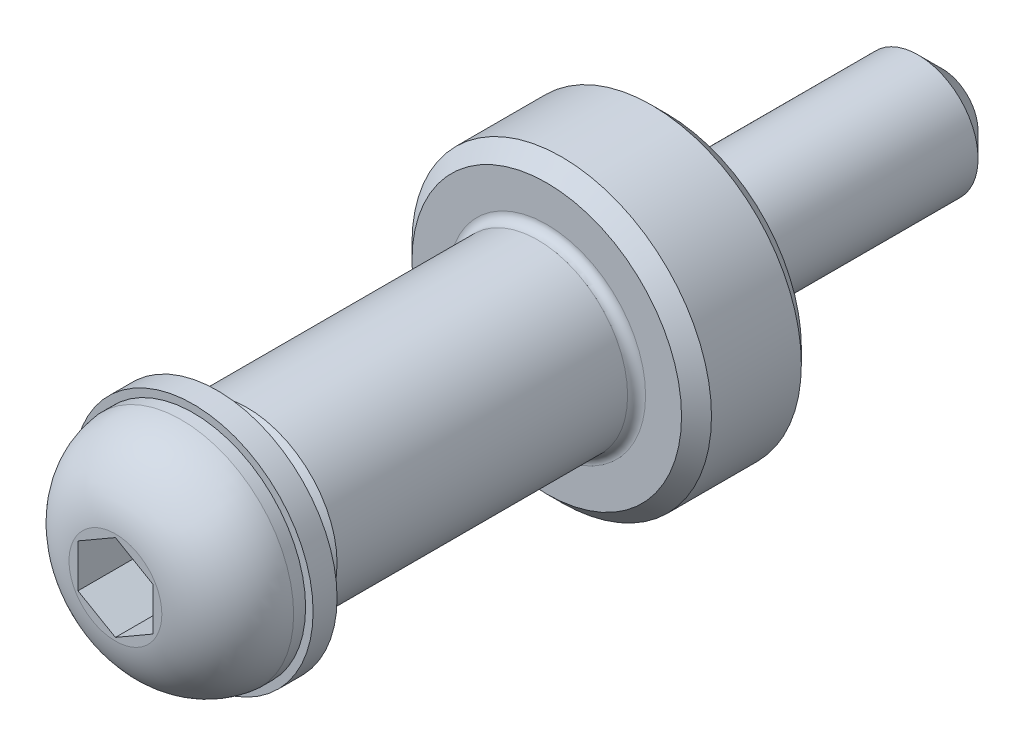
ISO-10303-21;
HEADER;
FILE_DESCRIPTION(('STEP AP214'),'2;1');
FILE_NAME('part.step','',(''),(''),'','','');
FILE_SCHEMA(('AUTOMOTIVE_DESIGN { 1 0 10303 214 1 1 1 1 }'));
ENDSEC;
DATA;
#1=APPLICATION_CONTEXT('core data for automotive mechanical design processes');
#2=APPLICATION_PROTOCOL_DEFINITION('international standard','automotive_design',2000,#1);
#3=PRODUCT_CONTEXT('',#1,'mechanical');
#4=PRODUCT('Part','Part','',(#3));
#5=PRODUCT_RELATED_PRODUCT_CATEGORY('part','',(#4));
#6=PRODUCT_DEFINITION_FORMATION('','',#4);
#7=PRODUCT_DEFINITION_CONTEXT('part definition',#1,'design');
#8=PRODUCT_DEFINITION('design','',#6,#7);
#9=PRODUCT_DEFINITION_SHAPE('','',#8);
#10=(LENGTH_UNIT() NAMED_UNIT(*) SI_UNIT(.MILLI.,.METRE.));
#11=(NAMED_UNIT(*) PLANE_ANGLE_UNIT() SI_UNIT($,.RADIAN.));
#12=(NAMED_UNIT(*) SI_UNIT($,.STERADIAN.) SOLID_ANGLE_UNIT());
#13=UNCERTAINTY_MEASURE_WITH_UNIT(LENGTH_MEASURE(1.E-05),#10,'distance_accuracy_value','');
#14=(GEOMETRIC_REPRESENTATION_CONTEXT(3) GLOBAL_UNCERTAINTY_ASSIGNED_CONTEXT((#13)) GLOBAL_UNIT_ASSIGNED_CONTEXT((#10,
#11,#12)) REPRESENTATION_CONTEXT('',''));
#15=CARTESIAN_POINT('',(0.,0.,0.));
#16=DIRECTION('',(0.,0.,1.));
#17=DIRECTION('',(1.,0.,0.));
#18=AXIS2_PLACEMENT_3D('',#15,#16,#17);
#19=CARTESIAN_POINT('',(0.,0.,4.));
#20=DIRECTION('',(0.,0.,1.));
#21=DIRECTION('',(1.,0.,0.));
#22=AXIS2_PLACEMENT_3D('',#19,#20,#21);
#23=PLANE('',#22);
#24=CARTESIAN_POINT('',(0.,0.,4.));
#25=DIRECTION('',(0.,0.,1.));
#26=DIRECTION('',(1.,0.,0.));
#27=AXIS2_PLACEMENT_3D('',#24,#25,#26);
#28=CIRCLE('',#27,3.3);
#29=CARTESIAN_POINT('',(3.3,0.,4.));
#30=VERTEX_POINT('',#29);
#31=EDGE_CURVE('E9',#30,#30,#28,.F.);
#32=ORIENTED_EDGE('',*,*,#31,.T.);
#33=EDGE_LOOP('',(#32));
#34=FACE_BOUND('',#33,.T.);
#35=CARTESIAN_POINT('',(0.,0.,4.));
#36=DIRECTION('',(0.,0.,1.));
#37=DIRECTION('',(1.,0.,0.));
#38=AXIS2_PLACEMENT_3D('',#35,#36,#37);
#39=CIRCLE('',#38,4.5);
#40=CARTESIAN_POINT('',(4.5,0.,4.));
#41=VERTEX_POINT('',#40);
#42=EDGE_CURVE('E162',#41,#41,#39,.T.);
#43=ORIENTED_EDGE('',*,*,#42,.T.);
#44=EDGE_LOOP('',(#43));
#45=FACE_BOUND('',#44,.T.);
#46=ADVANCED_FACE('F14',(#34,#45),#23,.T.);
#47=CARTESIAN_POINT('',(0.,0.,4.3));
#48=DIRECTION('',(0.,0.,1.));
#49=DIRECTION('',(1.,0.,0.));
#50=AXIS2_PLACEMENT_3D('',#47,#48,#49);
#51=TOROIDAL_SURFACE('',#50,3.3,0.3);
#52=ORIENTED_EDGE('',*,*,#31,.F.);
#53=EDGE_LOOP('',(#52));
#54=FACE_BOUND('',#53,.T.);
#55=CARTESIAN_POINT('',(0.,0.,4.3));
#56=DIRECTION('',(0.,0.,1.));
#57=DIRECTION('',(1.,0.,0.));
#58=AXIS2_PLACEMENT_3D('',#55,#56,#57);
#59=CIRCLE('',#58,3.);
#60=CARTESIAN_POINT('',(3.,0.,4.3));
#61=VERTEX_POINT('',#60);
#62=EDGE_CURVE('E23',#61,#61,#59,.T.);
#63=ORIENTED_EDGE('',*,*,#62,.F.);
#64=EDGE_LOOP('',(#63));
#65=FACE_BOUND('',#64,.T.);
#66=ADVANCED_FACE('F201',(#54,#65),#51,.F.);
#67=CARTESIAN_POINT('',(0.,0.,4.));
#68=DIRECTION('',(0.,0.,1.));
#69=DIRECTION('',(1.,0.,0.));
#70=AXIS2_PLACEMENT_3D('',#67,#68,#69);
#71=CYLINDRICAL_SURFACE('',#70,3.);
#72=ORIENTED_EDGE('',*,*,#62,.T.);
#73=EDGE_LOOP('',(#72));
#74=FACE_BOUND('',#73,.T.);
#75=CARTESIAN_POINT('',(0.,0.,14.));
#76=DIRECTION('',(0.,0.,1.));
#77=DIRECTION('',(1.,0.,0.));
#78=AXIS2_PLACEMENT_3D('',#75,#76,#77);
#79=CIRCLE('',#78,3.);
#80=CARTESIAN_POINT('',(3.,0.,14.));
#81=VERTEX_POINT('',#80);
#82=EDGE_CURVE('E159',#81,#81,#79,.F.);
#83=ORIENTED_EDGE('',*,*,#82,.T.);
#84=EDGE_LOOP('',(#83));
#85=FACE_BOUND('',#84,.T.);
#86=ADVANCED_FACE('F208',(#74,#85),#71,.T.);
#87=CARTESIAN_POINT('',(0.,0.,14.5));
#88=DIRECTION('',(0.,0.,-1.));
#89=DIRECTION('',(-1.,0.,0.));
#90=AXIS2_PLACEMENT_3D('',#87,#88,#89);
#91=CONICAL_SURFACE('',#90,2.5,0.785398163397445);
#92=ORIENTED_EDGE('',*,*,#82,.F.);
#93=EDGE_LOOP('',(#92));
#94=FACE_BOUND('',#93,.T.);
#95=CARTESIAN_POINT('',(0.,0.,14.5));
#96=DIRECTION('',(0.,0.,1.));
#97=DIRECTION('',(1.,0.,0.));
#98=AXIS2_PLACEMENT_3D('',#95,#96,#97);
#99=CIRCLE('',#98,2.5);
#100=CARTESIAN_POINT('',(2.5,0.,14.5));
#101=VERTEX_POINT('',#100);
#102=EDGE_CURVE('E154',#101,#101,#99,.T.);
#103=ORIENTED_EDGE('',*,*,#102,.F.);
#104=EDGE_LOOP('',(#103));
#105=FACE_BOUND('',#104,.T.);
#106=ADVANCED_FACE('F226',(#94,#105),#91,.T.);
#107=CARTESIAN_POINT('',(0.,0.,14.5));
#108=DIRECTION('',(0.,0.,1.));
#109=DIRECTION('',(1.,0.,0.));
#110=AXIS2_PLACEMENT_3D('',#107,#108,#109);
#111=PLANE('',#110);
#112=ORIENTED_EDGE('',*,*,#102,.T.);
#113=EDGE_LOOP('',(#112));
#114=FACE_BOUND('',#113,.T.);
#115=CARTESIAN_POINT('',(0.,0.,14.5));
#116=DIRECTION('',(0.,0.,1.));
#117=DIRECTION('',(1.,0.,0.));
#118=AXIS2_PLACEMENT_3D('',#115,#116,#117);
#119=CIRCLE('',#118,2.);
#120=CARTESIAN_POINT('',(2.,0.,14.5));
#121=VERTEX_POINT('',#120);
#122=EDGE_CURVE('E149',#121,#121,#119,.F.);
#123=ORIENTED_EDGE('',*,*,#122,.T.);
#124=EDGE_LOOP('',(#123));
#125=FACE_BOUND('',#124,.T.);
#126=ADVANCED_FACE('F229',(#114,#125),#111,.T.);
#127=CARTESIAN_POINT('',(0.,0.,4.));
#128=DIRECTION('',(0.,0.,-1.));
#129=DIRECTION('',(-1.,0.,0.));
#130=AXIS2_PLACEMENT_3D('',#127,#128,#129);
#131=CONICAL_SURFACE('',#130,4.5,0.785398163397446);
#132=CARTESIAN_POINT('',(0.,0.,3.5));
#133=DIRECTION('',(0.,0.,1.));
#134=DIRECTION('',(1.,0.,0.));
#135=AXIS2_PLACEMENT_3D('',#132,#133,#134);
#136=CIRCLE('',#135,5.);
#137=CARTESIAN_POINT('',(5.,0.,3.5));
#138=VERTEX_POINT('',#137);
#139=EDGE_CURVE('E168',#138,#138,#136,.F.);
#140=ORIENTED_EDGE('',*,*,#139,.F.);
#141=EDGE_LOOP('',(#140));
#142=FACE_BOUND('',#141,.T.);
#143=ORIENTED_EDGE('',*,*,#42,.F.);
#144=EDGE_LOOP('',(#143));
#145=FACE_BOUND('',#144,.T.);
#146=ADVANCED_FACE('F224',(#142,#145),#131,.T.);
#147=CARTESIAN_POINT('',(0.,0.,9.5));
#148=DIRECTION('',(0.,0.,-1.));
#149=DIRECTION('',(-1.,0.,0.));
#150=AXIS2_PLACEMENT_3D('',#147,#148,#149);
#151=CYLINDRICAL_SURFACE('',#150,5.);
#152=ORIENTED_EDGE('',*,*,#139,.T.);
#153=EDGE_LOOP('',(#152));
#154=FACE_BOUND('',#153,.T.);
#155=CARTESIAN_POINT('',(0.,0.,0.5));
#156=DIRECTION('',(0.,0.,1.));
#157=DIRECTION('',(1.,0.,0.));
#158=AXIS2_PLACEMENT_3D('',#155,#156,#157);
#159=CIRCLE('',#158,5.);
#160=CARTESIAN_POINT('',(5.,0.,0.5));
#161=VERTEX_POINT('',#160);
#162=EDGE_CURVE('E165',#161,#161,#159,.T.);
#163=ORIENTED_EDGE('',*,*,#162,.T.);
#164=EDGE_LOOP('',(#163));
#165=FACE_BOUND('',#164,.T.);
#166=ADVANCED_FACE('F221',(#154,#165),#151,.T.);
#167=CARTESIAN_POINT('',(0.,0.,0.5));
#168=DIRECTION('',(0.,0.,1.));
#169=DIRECTION('',(1.,0.,0.));
#170=AXIS2_PLACEMENT_3D('',#167,#168,#169);
#171=CONICAL_SURFACE('',#170,5.,0.785398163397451);
#172=CARTESIAN_POINT('',(0.,0.,0.));
#173=DIRECTION('',(0.,0.,1.));
#174=DIRECTION('',(1.,0.,0.));
#175=AXIS2_PLACEMENT_3D('',#172,#173,#174);
#176=CIRCLE('',#175,4.5);
#177=CARTESIAN_POINT('',(4.5,0.,0.));
#178=VERTEX_POINT('',#177);
#179=EDGE_CURVE('E171',#178,#178,#176,.F.);
#180=ORIENTED_EDGE('',*,*,#179,.F.);
#181=EDGE_LOOP('',(#180));
#182=FACE_BOUND('',#181,.T.);
#183=ORIENTED_EDGE('',*,*,#162,.F.);
#184=EDGE_LOOP('',(#183));
#185=FACE_BOUND('',#184,.T.);
#186=ADVANCED_FACE('F218',(#182,#185),#171,.T.);
#187=CARTESIAN_POINT('',(0.,0.,0.));
#188=DIRECTION('',(0.,0.,1.));
#189=DIRECTION('',(1.,0.,0.));
#190=AXIS2_PLACEMENT_3D('',#187,#188,#189);
#191=PLANE('',#190);
#192=ORIENTED_EDGE('',*,*,#179,.T.);
#193=EDGE_LOOP('',(#192));
#194=FACE_BOUND('',#193,.T.);
#195=CARTESIAN_POINT('',(0.,0.,0.));
#196=DIRECTION('',(0.,0.,-1.));
#197=DIRECTION('',(-1.,0.,0.));
#198=AXIS2_PLACEMENT_3D('',#195,#196,#197);
#199=CIRCLE('',#198,2.);
#200=CARTESIAN_POINT('',(-2.,0.,0.));
#201=VERTEX_POINT('',#200);
#202=EDGE_CURVE('E145',#201,#201,#199,.T.);
#203=ORIENTED_EDGE('',*,*,#202,.F.);
#204=EDGE_LOOP('',(#203));
#205=FACE_BOUND('',#204,.T.);
#206=ADVANCED_FACE('F215',(#194,#205),#191,.F.);
#207=CARTESIAN_POINT('',(0.,1.44337567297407,16.4));
#208=DIRECTION('',(0.,0.,1.));
#209=DIRECTION('',(1.,0.,0.));
#210=AXIS2_PLACEMENT_3D('',#207,#208,#209);
#211=PLANE('',#210);
#212=DIRECTION('',(-0.866025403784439,0.5,0.));
#213=VECTOR('',#212,1.);
#214=CARTESIAN_POINT('',(1.25,0.721687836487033,16.4));
#215=LINE('',#214,#213);
#216=CARTESIAN_POINT('',(1.25,0.721687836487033,16.4));
#217=VERTEX_POINT('',#216);
#218=CARTESIAN_POINT('',(0.,1.44337567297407,16.4));
#219=VERTEX_POINT('',#218);
#220=EDGE_CURVE('E116',#217,#219,#215,.T.);
#221=ORIENTED_EDGE('',*,*,#220,.T.);
#222=DIRECTION('',(-0.866025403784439,-0.5,0.));
#223=VECTOR('',#222,1.);
#224=CARTESIAN_POINT('',(0.,1.44337567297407,16.4));
#225=LINE('',#224,#223);
#226=CARTESIAN_POINT('',(-1.25,0.721687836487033,16.4));
#227=VERTEX_POINT('',#226);
#228=EDGE_CURVE('E99',#219,#227,#225,.T.);
#229=ORIENTED_EDGE('',*,*,#228,.T.);
#230=DIRECTION('',(0.,-1.,0.));
#231=VECTOR('',#230,1.);
#232=CARTESIAN_POINT('',(-1.25,0.721687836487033,16.4));
#233=LINE('',#232,#231);
#234=CARTESIAN_POINT('',(-1.25,-0.721687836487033,16.4));
#235=VERTEX_POINT('',#234);
#236=EDGE_CURVE('E97',#227,#235,#233,.T.);
#237=ORIENTED_EDGE('',*,*,#236,.T.);
#238=DIRECTION('',(0.866025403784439,-0.5,0.));
#239=VECTOR('',#238,1.);
#240=CARTESIAN_POINT('',(-1.25,-0.721687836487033,16.4));
#241=LINE('',#240,#239);
#242=CARTESIAN_POINT('',(0.,-1.44337567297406,16.4));
#243=VERTEX_POINT('',#242);
#244=EDGE_CURVE('E76',#235,#243,#241,.T.);
#245=ORIENTED_EDGE('',*,*,#244,.T.);
#246=DIRECTION('',(0.866025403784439,0.5,0.));
#247=VECTOR('',#246,1.);
#248=CARTESIAN_POINT('',(0.,-1.44337567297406,16.4));
#249=LINE('',#248,#247);
#250=CARTESIAN_POINT('',(1.25,-0.721687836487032,16.4));
#251=VERTEX_POINT('',#250);
#252=EDGE_CURVE('E87',#243,#251,#249,.T.);
#253=ORIENTED_EDGE('',*,*,#252,.T.);
#254=DIRECTION('',(0.,1.,0.));
#255=VECTOR('',#254,1.);
#256=CARTESIAN_POINT('',(1.25,-0.721687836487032,16.4));
#257=LINE('',#256,#255);
#258=EDGE_CURVE('E91',#251,#217,#257,.T.);
#259=ORIENTED_EDGE('',*,*,#258,.T.);
#260=EDGE_LOOP('',(#221,#229,#237,#245,#253,#259));
#261=FACE_BOUND('',#260,.T.);
#262=ADVANCED_FACE('F94',(#261),#211,.T.);
#263=CARTESIAN_POINT('',(-1.25,0.721687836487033,16.4));
#264=DIRECTION('',(-1.,0.,0.));
#265=DIRECTION('',(0.,-1.,0.));
#266=AXIS2_PLACEMENT_3D('',#263,#264,#265);
#267=PLANE('',#266);
#268=DIRECTION('',(0.,-1.,0.));
#269=VECTOR('',#268,1.);
#270=CARTESIAN_POINT('',(-1.25,0.721687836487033,18.4));
#271=LINE('',#270,#269);
#272=CARTESIAN_POINT('',(-1.25,0.721687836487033,18.4));
#273=VERTEX_POINT('',#272);
#274=CARTESIAN_POINT('',(-1.25,-0.721687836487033,18.4));
#275=VERTEX_POINT('',#274);
#276=EDGE_CURVE('E108',#273,#275,#271,.T.);
#277=ORIENTED_EDGE('',*,*,#276,.T.);
#278=DIRECTION('',(0.,0.,1.));
#279=VECTOR('',#278,1.);
#280=CARTESIAN_POINT('',(-1.25,-0.721687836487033,16.4));
#281=LINE('',#280,#279);
#282=EDGE_CURVE('E84',#235,#275,#281,.T.);
#283=ORIENTED_EDGE('',*,*,#282,.F.);
#284=ORIENTED_EDGE('',*,*,#236,.F.);
#285=DIRECTION('',(0.,0.,1.));
#286=VECTOR('',#285,1.);
#287=CARTESIAN_POINT('',(-1.25,0.721687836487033,16.4));
#288=LINE('',#287,#286);
#289=EDGE_CURVE('E121',#227,#273,#288,.T.);
#290=ORIENTED_EDGE('',*,*,#289,.T.);
#291=EDGE_LOOP('',(#277,#283,#284,#290));
#292=FACE_BOUND('',#291,.T.);
#293=ADVANCED_FACE('F181',(#292),#267,.F.);
#294=CARTESIAN_POINT('',(-1.25,-0.721687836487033,16.4));
#295=DIRECTION('',(-0.5,-0.866025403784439,0.));
#296=DIRECTION('',(0.866025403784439,-0.5,0.));
#297=AXIS2_PLACEMENT_3D('',#294,#295,#296);
#298=PLANE('',#297);
#299=DIRECTION('',(0.866025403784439,-0.5,0.));
#300=VECTOR('',#299,1.);
#301=CARTESIAN_POINT('',(-1.25,-0.721687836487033,18.4));
#302=LINE('',#301,#300);
#303=CARTESIAN_POINT('',(0.,-1.44337567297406,18.4));
#304=VERTEX_POINT('',#303);
#305=EDGE_CURVE('E79',#275,#304,#302,.T.);
#306=ORIENTED_EDGE('',*,*,#305,.T.);
#307=DIRECTION('',(0.,0.,1.));
#308=VECTOR('',#307,1.);
#309=CARTESIAN_POINT('',(0.,-1.44337567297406,16.4));
#310=LINE('',#309,#308);
#311=EDGE_CURVE('E72',#243,#304,#310,.T.);
#312=ORIENTED_EDGE('',*,*,#311,.F.);
#313=ORIENTED_EDGE('',*,*,#244,.F.);
#314=ORIENTED_EDGE('',*,*,#282,.T.);
#315=EDGE_LOOP('',(#306,#312,#313,#314));
#316=FACE_BOUND('',#315,.T.);
#317=ADVANCED_FACE('F74',(#316),#298,.F.);
#318=CARTESIAN_POINT('',(0.,-1.44337567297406,16.4));
#319=DIRECTION('',(0.5,-0.866025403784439,0.));
#320=DIRECTION('',(0.866025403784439,0.5,0.));
#321=AXIS2_PLACEMENT_3D('',#318,#319,#320);
#322=PLANE('',#321);
#323=DIRECTION('',(0.866025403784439,0.5,0.));
#324=VECTOR('',#323,1.);
#325=CARTESIAN_POINT('',(0.,-1.44337567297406,18.4));
#326=LINE('',#325,#324);
#327=CARTESIAN_POINT('',(1.25,-0.721687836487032,18.4));
#328=VERTEX_POINT('',#327);
#329=EDGE_CURVE('E112',#304,#328,#326,.T.);
#330=ORIENTED_EDGE('',*,*,#329,.T.);
#331=DIRECTION('',(0.,0.,1.));
#332=VECTOR('',#331,1.);
#333=CARTESIAN_POINT('',(1.25,-0.721687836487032,16.4));
#334=LINE('',#333,#332);
#335=EDGE_CURVE('E83',#251,#328,#334,.T.);
#336=ORIENTED_EDGE('',*,*,#335,.F.);
#337=ORIENTED_EDGE('',*,*,#252,.F.);
#338=ORIENTED_EDGE('',*,*,#311,.T.);
#339=EDGE_LOOP('',(#330,#336,#337,#338));
#340=FACE_BOUND('',#339,.T.);
#341=ADVANCED_FACE('F88',(#340),#322,.F.);
#342=CARTESIAN_POINT('',(1.25,-0.721687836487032,16.4));
#343=DIRECTION('',(1.,0.,0.));
#344=DIRECTION('',(0.,0.,-1.));
#345=AXIS2_PLACEMENT_3D('',#342,#343,#344);
#346=PLANE('',#345);
#347=DIRECTION('',(0.,1.,0.));
#348=VECTOR('',#347,1.);
#349=CARTESIAN_POINT('',(1.25,-0.721687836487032,18.4));
#350=LINE('',#349,#348);
#351=CARTESIAN_POINT('',(1.25,0.721687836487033,18.4));
#352=VERTEX_POINT('',#351);
#353=EDGE_CURVE('E114',#328,#352,#350,.T.);
#354=ORIENTED_EDGE('',*,*,#353,.T.);
#355=DIRECTION('',(0.,0.,1.));
#356=VECTOR('',#355,1.);
#357=CARTESIAN_POINT('',(1.25,0.721687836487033,16.4));
#358=LINE('',#357,#356);
#359=EDGE_CURVE('E39',#217,#352,#358,.T.);
#360=ORIENTED_EDGE('',*,*,#359,.F.);
#361=ORIENTED_EDGE('',*,*,#258,.F.);
#362=ORIENTED_EDGE('',*,*,#335,.T.);
#363=EDGE_LOOP('',(#354,#360,#361,#362));
#364=FACE_BOUND('',#363,.T.);
#365=ADVANCED_FACE('F186',(#364),#346,.F.);
#366=CARTESIAN_POINT('',(1.25,0.721687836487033,16.4));
#367=DIRECTION('',(0.5,0.866025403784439,0.));
#368=DIRECTION('',(-0.866025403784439,0.5,0.));
#369=AXIS2_PLACEMENT_3D('',#366,#367,#368);
#370=PLANE('',#369);
#371=DIRECTION('',(-0.866025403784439,0.5,0.));
#372=VECTOR('',#371,1.);
#373=CARTESIAN_POINT('',(1.25,0.721687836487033,18.4));
#374=LINE('',#373,#372);
#375=CARTESIAN_POINT('',(0.,1.44337567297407,18.4));
#376=VERTEX_POINT('',#375);
#377=EDGE_CURVE('E31',#352,#376,#374,.T.);
#378=ORIENTED_EDGE('',*,*,#377,.T.);
#379=DIRECTION('',(0.,0.,1.));
#380=VECTOR('',#379,1.);
#381=CARTESIAN_POINT('',(0.,1.44337567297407,16.4));
#382=LINE('',#381,#380);
#383=EDGE_CURVE('E61',#219,#376,#382,.T.);
#384=ORIENTED_EDGE('',*,*,#383,.F.);
#385=ORIENTED_EDGE('',*,*,#220,.F.);
#386=ORIENTED_EDGE('',*,*,#359,.T.);
#387=EDGE_LOOP('',(#378,#384,#385,#386));
#388=FACE_BOUND('',#387,.T.);
#389=ADVANCED_FACE('F188',(#388),#370,.F.);
#390=CARTESIAN_POINT('',(0.,1.44337567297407,16.4));
#391=DIRECTION('',(-0.5,0.866025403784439,0.));
#392=DIRECTION('',(-0.866025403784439,-0.5,0.));
#393=AXIS2_PLACEMENT_3D('',#390,#391,#392);
#394=PLANE('',#393);
#395=DIRECTION('',(-0.866025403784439,-0.5,0.));
#396=VECTOR('',#395,1.);
#397=CARTESIAN_POINT('',(0.,1.44337567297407,18.4));
#398=LINE('',#397,#396);
#399=EDGE_CURVE('E105',#376,#273,#398,.T.);
#400=ORIENTED_EDGE('',*,*,#399,.T.);
#401=ORIENTED_EDGE('',*,*,#289,.F.);
#402=ORIENTED_EDGE('',*,*,#228,.F.);
#403=ORIENTED_EDGE('',*,*,#383,.T.);
#404=EDGE_LOOP('',(#400,#401,#402,#403));
#405=FACE_BOUND('',#404,.T.);
#406=ADVANCED_FACE('F177',(#405),#394,.F.);
#407=CARTESIAN_POINT('',(0.,1.54999999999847,18.4));
#408=DIRECTION('',(0.,0.,-1.));
#409=DIRECTION('',(-1.,0.,0.));
#410=AXIS2_PLACEMENT_3D('',#407,#408,#409);
#411=PLANE('',#410);
#412=ORIENTED_EDGE('',*,*,#399,.F.);
#413=ORIENTED_EDGE('',*,*,#377,.F.);
#414=ORIENTED_EDGE('',*,*,#353,.F.);
#415=ORIENTED_EDGE('',*,*,#329,.F.);
#416=ORIENTED_EDGE('',*,*,#305,.F.);
#417=ORIENTED_EDGE('',*,*,#276,.F.);
#418=EDGE_LOOP('',(#412,#413,#414,#415,#416,#417));
#419=FACE_BOUND('',#418,.T.);
#420=CARTESIAN_POINT('',(0.,0.,18.4));
#421=DIRECTION('',(0.,0.,1.));
#422=DIRECTION('',(1.,0.,0.));
#423=AXIS2_PLACEMENT_3D('',#420,#421,#422);
#424=CIRCLE('',#423,1.54999999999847);
#425=CARTESIAN_POINT('',(1.54999999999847,0.,18.4));
#426=VERTEX_POINT('',#425);
#427=EDGE_CURVE('E126',#426,#426,#424,.T.);
#428=ORIENTED_EDGE('',*,*,#427,.T.);
#429=EDGE_LOOP('',(#428));
#430=FACE_BOUND('',#429,.T.);
#431=ADVANCED_FACE('F183',(#419,#430),#411,.F.);
#432=CARTESIAN_POINT('',(0.,0.,15.9161647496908));
#433=DIRECTION('',(0.,0.,1.));
#434=DIRECTION('',(1.,0.,0.));
#435=AXIS2_PLACEMENT_3D('',#432,#433,#434);
#436=DEGENERATE_TOROIDAL_SURFACE('',#435,1.26616474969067,2.49999999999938,.T.);
#437=ORIENTED_EDGE('',*,*,#427,.F.);
#438=EDGE_LOOP('',(#437));
#439=FACE_BOUND('',#438,.T.);
#440=CARTESIAN_POINT('',(0.,0.,16.1999999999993));
#441=DIRECTION('',(0.,0.,1.));
#442=DIRECTION('',(1.,0.,0.));
#443=AXIS2_PLACEMENT_3D('',#440,#441,#442);
#444=CIRCLE('',#443,3.75);
#445=CARTESIAN_POINT('',(3.75,0.,16.1999999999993));
#446=VERTEX_POINT('',#445);
#447=EDGE_CURVE('E129',#446,#446,#444,.T.);
#448=ORIENTED_EDGE('',*,*,#447,.T.);
#449=EDGE_LOOP('',(#448));
#450=FACE_BOUND('',#449,.T.);
#451=ADVANCED_FACE('F254',(#439,#450),#436,.T.);
#452=CARTESIAN_POINT('',(0.,0.,20.9));
#453=DIRECTION('',(0.,0.,1.));
#454=DIRECTION('',(1.,0.,0.));
#455=AXIS2_PLACEMENT_3D('',#452,#453,#454);
#456=CYLINDRICAL_SURFACE('',#455,3.75);
#457=ORIENTED_EDGE('',*,*,#447,.F.);
#458=EDGE_LOOP('',(#457));
#459=FACE_BOUND('',#458,.T.);
#460=CARTESIAN_POINT('',(0.,0.,15.8));
#461=DIRECTION('',(0.,0.,1.));
#462=DIRECTION('',(1.,0.,0.));
#463=AXIS2_PLACEMENT_3D('',#460,#461,#462);
#464=CIRCLE('',#463,3.75);
#465=CARTESIAN_POINT('',(3.75,0.,15.8));
#466=VERTEX_POINT('',#465);
#467=EDGE_CURVE('E132',#466,#466,#464,.T.);
#468=ORIENTED_EDGE('',*,*,#467,.T.);
#469=EDGE_LOOP('',(#468));
#470=FACE_BOUND('',#469,.T.);
#471=ADVANCED_FACE('F263',(#459,#470),#456,.T.);
#472=CARTESIAN_POINT('',(0.,3.75,15.8));
#473=DIRECTION('',(0.,0.,-1.));
#474=DIRECTION('',(-1.,0.,0.));
#475=AXIS2_PLACEMENT_3D('',#472,#473,#474);
#476=PLANE('',#475);
#477=ORIENTED_EDGE('',*,*,#467,.F.);
#478=EDGE_LOOP('',(#477));
#479=FACE_BOUND('',#478,.T.);
#480=CARTESIAN_POINT('',(0.,0.,15.8));
#481=DIRECTION('',(0.,0.,1.));
#482=DIRECTION('',(1.,0.,0.));
#483=AXIS2_PLACEMENT_3D('',#480,#481,#482);
#484=CIRCLE('',#483,3.99999999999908);
#485=CARTESIAN_POINT('',(3.99999999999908,0.,15.8));
#486=VERTEX_POINT('',#485);
#487=EDGE_CURVE('E135',#486,#486,#484,.T.);
#488=ORIENTED_EDGE('',*,*,#487,.T.);
#489=EDGE_LOOP('',(#488));
#490=FACE_BOUND('',#489,.T.);
#491=ADVANCED_FACE('F267',(#479,#490),#476,.F.);
#492=CARTESIAN_POINT('',(0.,0.,20.9));
#493=DIRECTION('',(0.,0.,1.));
#494=DIRECTION('',(1.,0.,0.));
#495=AXIS2_PLACEMENT_3D('',#492,#493,#494);
#496=CYLINDRICAL_SURFACE('',#495,3.99999999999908);
#497=ORIENTED_EDGE('',*,*,#487,.F.);
#498=EDGE_LOOP('',(#497));
#499=FACE_BOUND('',#498,.T.);
#500=CARTESIAN_POINT('',(0.,0.,15.));
#501=DIRECTION('',(0.,0.,1.));
#502=DIRECTION('',(1.,0.,0.));
#503=AXIS2_PLACEMENT_3D('',#500,#501,#502);
#504=CIRCLE('',#503,3.99999999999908);
#505=CARTESIAN_POINT('',(3.99999999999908,0.,15.));
#506=VERTEX_POINT('',#505);
#507=EDGE_CURVE('E138',#506,#506,#504,.T.);
#508=ORIENTED_EDGE('',*,*,#507,.T.);
#509=EDGE_LOOP('',(#508));
#510=FACE_BOUND('',#509,.T.);
#511=ADVANCED_FACE('F271',(#499,#510),#496,.T.);
#512=CARTESIAN_POINT('',(0.,2.,15.));
#513=DIRECTION('',(0.,0.,1.));
#514=DIRECTION('',(1.,0.,0.));
#515=AXIS2_PLACEMENT_3D('',#512,#513,#514);
#516=PLANE('',#515);
#517=ORIENTED_EDGE('',*,*,#507,.F.);
#518=EDGE_LOOP('',(#517));
#519=FACE_BOUND('',#518,.T.);
#520=CARTESIAN_POINT('',(0.,0.,15.));
#521=DIRECTION('',(0.,0.,1.));
#522=DIRECTION('',(1.,0.,0.));
#523=AXIS2_PLACEMENT_3D('',#520,#521,#522);
#524=CIRCLE('',#523,2.);
#525=CARTESIAN_POINT('',(2.,0.,15.));
#526=VERTEX_POINT('',#525);
#527=EDGE_CURVE('E118',#526,#526,#524,.T.);
#528=ORIENTED_EDGE('',*,*,#527,.T.);
#529=EDGE_LOOP('',(#528));
#530=FACE_BOUND('',#529,.T.);
#531=ADVANCED_FACE('F220',(#519,#530),#516,.F.);
#532=CARTESIAN_POINT('',(0.,0.,20.9));
#533=DIRECTION('',(0.,0.,1.));
#534=DIRECTION('',(1.,0.,0.));
#535=AXIS2_PLACEMENT_3D('',#532,#533,#534);
#536=CYLINDRICAL_SURFACE('',#535,2.);
#537=ORIENTED_EDGE('',*,*,#122,.F.);
#538=EDGE_LOOP('',(#537));
#539=FACE_BOUND('',#538,.T.);
#540=ORIENTED_EDGE('',*,*,#527,.F.);
#541=EDGE_LOOP('',(#540));
#542=FACE_BOUND('',#541,.T.);
#543=ADVANCED_FACE('F197',(#539,#542),#536,.T.);
#544=CARTESIAN_POINT('',(0.,0.,-9.2));
#545=DIRECTION('',(0.,0.,-1.));
#546=DIRECTION('',(-1.,0.,0.));
#547=AXIS2_PLACEMENT_3D('',#544,#545,#546);
#548=PLANE('',#547);
#549=CARTESIAN_POINT('',(0.,0.,-9.2));
#550=DIRECTION('',(0.,0.,-1.));
#551=DIRECTION('',(-1.,0.,0.));
#552=AXIS2_PLACEMENT_3D('',#549,#550,#551);
#553=CIRCLE('',#552,1.2);
#554=CARTESIAN_POINT('',(-1.2,0.,-9.2));
#555=VERTEX_POINT('',#554);
#556=EDGE_CURVE('E140',#555,#555,#553,.T.);
#557=ORIENTED_EDGE('',*,*,#556,.T.);
#558=EDGE_LOOP('',(#557));
#559=FACE_BOUND('',#558,.T.);
#560=ADVANCED_FACE('F237',(#559),#548,.T.);
#561=CARTESIAN_POINT('',(0.,0.,-9.2));
#562=DIRECTION('',(0.,0.,1.));
#563=DIRECTION('',(1.,0.,0.));
#564=AXIS2_PLACEMENT_3D('',#561,#562,#563);
#565=CONICAL_SURFACE('',#564,1.2,0.785398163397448);
#566=CARTESIAN_POINT('',(0.,0.,-8.4));
#567=DIRECTION('',(0.,0.,-1.));
#568=DIRECTION('',(-1.,0.,0.));
#569=AXIS2_PLACEMENT_3D('',#566,#567,#568);
#570=CIRCLE('',#569,2.);
#571=CARTESIAN_POINT('',(-2.,0.,-8.4));
#572=VERTEX_POINT('',#571);
#573=EDGE_CURVE('E18',#572,#572,#570,.F.);
#574=ORIENTED_EDGE('',*,*,#573,.F.);
#575=EDGE_LOOP('',(#574));
#576=FACE_BOUND('',#575,.T.);
#577=ORIENTED_EDGE('',*,*,#556,.F.);
#578=EDGE_LOOP('',(#577));
#579=FACE_BOUND('',#578,.T.);
#580=ADVANCED_FACE('F16',(#576,#579),#565,.T.);
#581=ORIENTED_EDGE('',*,*,#573,.T.);
#582=EDGE_LOOP('',(#581));
#583=FACE_BOUND('',#582,.T.);
#584=ORIENTED_EDGE('',*,*,#202,.T.);
#585=EDGE_LOOP('',(#584));
#586=FACE_BOUND('',#585,.T.);
#587=ADVANCED_FACE('F239',(#583,#586),#536,.T.);
#588=CLOSED_SHELL('',(#46,#66,#86,#106,#126,#146,#166,#186,#206,#262,#293,#317,#341,#365,#389,
#406,#431,#451,#471,#491,#511,#531,#543,#560,#580,#587));
#589=MANIFOLD_SOLID_BREP('B1',#588);
#590=ADVANCED_BREP_SHAPE_REPRESENTATION('',(#18,#589),#14);
#591=SHAPE_DEFINITION_REPRESENTATION(#9,#590);
ENDSEC;
END-ISO-10303-21;
